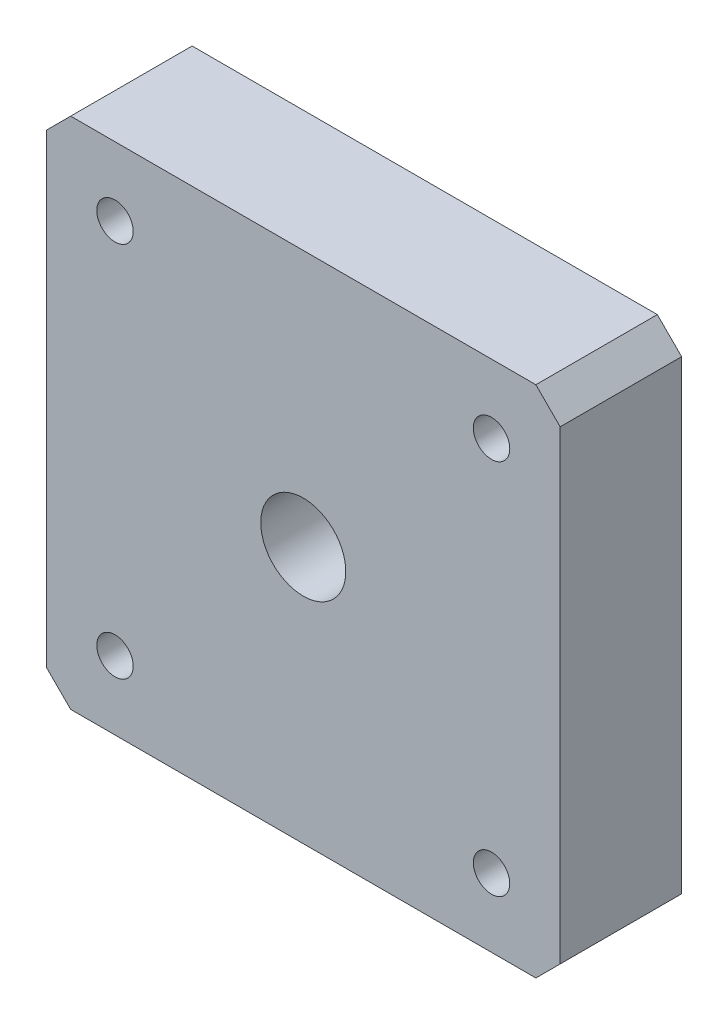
from build123d import *

# Parameters (mm, degrees)
EXTRUDE_1_DEPTH          = 10
SKETCH_2_R               = 11.5
SKETCH_2_R_2             = 11
CUT_EXTRUDE_1_DEPTH      = 0.5
EXTRUDE_START            = 2
SKETCH_3_R               = 11
EXTRUDE_2_DEPTH          = 2
SKETCH_4_R               = 3.5
CUT_EXTRUDE_2_DEPTH      = 12
SKETCH_5_R               = 1.5
CUT_EXTRUDE_3_DEPTH      = 12
PATTERN_CIRCULAR_1_COUNT = 4


with BuildPart() as part:
    # Sketch 1 → Extrude 1 (new body)
    with BuildSketch(Plane.XY):
        Polygon((-19.15, 21.15), (-21.15, 19.15), (-21.15, -19.15), (-19.15, -21.15), (19.15, -21.15), (21.15, -19.15), (21.15, 19.15), (19.15, 21.15), align=None)
    extrude(amount=EXTRUDE_1_DEPTH)

    # Sketch 2 → Cut-Extrude 1 (cut)
    with BuildSketch(Plane(origin=(0, 0, 0), x_dir=(-1, 0, 0), z_dir=(0, 0, -1))):
        Circle(SKETCH_2_R)
        Circle(SKETCH_2_R_2, mode=Mode.SUBTRACT)
    extrude(amount=-CUT_EXTRUDE_1_DEPTH, mode=Mode.SUBTRACT)

    # Sketch 3 → Extrude 2 (add)
    with BuildSketch(Plane(origin=(0, 0, 0), x_dir=(-1, 0, 0), z_dir=(0, 0, -1)).offset(EXTRUDE_START)):
        Circle(SKETCH_3_R)
    extrude(amount=-EXTRUDE_2_DEPTH)

    # Sketch 4 → Cut-Extrude 2 (cut)
    with BuildSketch(Plane(origin=(0, 0, -2), x_dir=(-1, 0, 0), z_dir=(0, 0, -1))):
        Circle(SKETCH_4_R)
    extrude(amount=-CUT_EXTRUDE_2_DEPTH, mode=Mode.SUBTRACT)

    # Sketch 5 → Cut-Extrude 3 (cut)
    with BuildSketch(Plane(origin=(0, 0, 0), x_dir=(-1, 0, 0), z_dir=(0, 0, -1))):
        with Locations((-15.5, 15.5)):
            Circle(SKETCH_5_R)
    cut_extrude_3 = extrude(amount=-CUT_EXTRUDE_3_DEPTH, mode=Mode.SUBTRACT)

    # Pattern Circular 1: Cut-Extrude 3 ×4 about axis
    pattern_circular_1_axis = Axis((0, 0, 0), (0, 0, 1))
    for i in range(1, PATTERN_CIRCULAR_1_COUNT):
        add(cut_extrude_3.rotate(pattern_circular_1_axis, i * 360 / PATTERN_CIRCULAR_1_COUNT), mode=Mode.SUBTRACT)


solid = part.part
